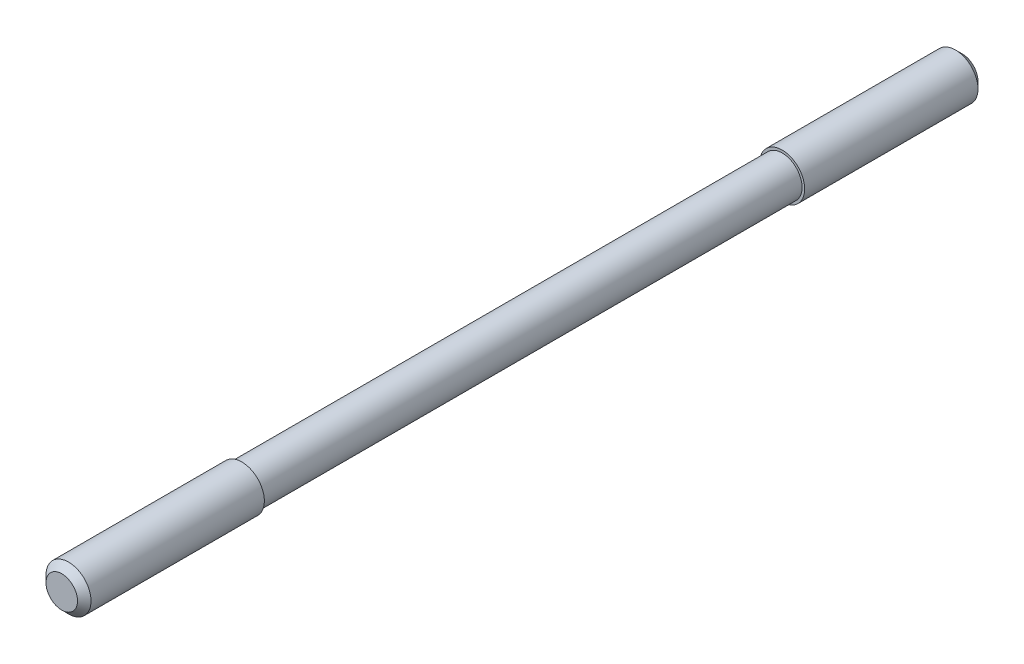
ISO-10303-21;
HEADER;
FILE_DESCRIPTION(('STEP AP214'),'2;1');
FILE_NAME('part.step','',(''),(''),'','','');
FILE_SCHEMA(('AUTOMOTIVE_DESIGN { 1 0 10303 214 1 1 1 1 }'));
ENDSEC;
DATA;
#1=APPLICATION_CONTEXT('core data for automotive mechanical design processes');
#2=APPLICATION_PROTOCOL_DEFINITION('international standard','automotive_design',2000,#1);
#3=PRODUCT_CONTEXT('',#1,'mechanical');
#4=PRODUCT('Part','Part','',(#3));
#5=PRODUCT_RELATED_PRODUCT_CATEGORY('part','',(#4));
#6=PRODUCT_DEFINITION_FORMATION('','',#4);
#7=PRODUCT_DEFINITION_CONTEXT('part definition',#1,'design');
#8=PRODUCT_DEFINITION('design','',#6,#7);
#9=PRODUCT_DEFINITION_SHAPE('','',#8);
#10=(LENGTH_UNIT() NAMED_UNIT(*) SI_UNIT(.MILLI.,.METRE.));
#11=(NAMED_UNIT(*) PLANE_ANGLE_UNIT() SI_UNIT($,.RADIAN.));
#12=(NAMED_UNIT(*) SI_UNIT($,.STERADIAN.) SOLID_ANGLE_UNIT());
#13=UNCERTAINTY_MEASURE_WITH_UNIT(LENGTH_MEASURE(1.E-05),#10,'distance_accuracy_value','');
#14=(GEOMETRIC_REPRESENTATION_CONTEXT(3) GLOBAL_UNCERTAINTY_ASSIGNED_CONTEXT((#13)) GLOBAL_UNIT_ASSIGNED_CONTEXT((#10,
#11,#12)) REPRESENTATION_CONTEXT('',''));
#15=CARTESIAN_POINT('',(0.,0.,0.));
#16=DIRECTION('',(0.,0.,1.));
#17=DIRECTION('',(1.,0.,0.));
#18=AXIS2_PLACEMENT_3D('',#15,#16,#17);
#19=CARTESIAN_POINT('',(0.,0.,0.));
#20=DIRECTION('',(0.,0.,1.));
#21=DIRECTION('',(1.,0.,0.));
#22=AXIS2_PLACEMENT_3D('',#19,#20,#21);
#23=PLANE('',#22);
#24=CARTESIAN_POINT('',(0.,0.,0.));
#25=DIRECTION('',(0.,0.,1.));
#26=DIRECTION('',(1.,0.,0.));
#27=AXIS2_PLACEMENT_3D('',#24,#25,#26);
#28=CIRCLE('',#27,2.8);
#29=CARTESIAN_POINT('',(2.8,0.,0.));
#30=VERTEX_POINT('',#29);
#31=EDGE_CURVE('E8',#30,#30,#28,.T.);
#32=ORIENTED_EDGE('',*,*,#31,.F.);
#33=EDGE_LOOP('',(#32));
#34=FACE_BOUND('',#33,.T.);
#35=ADVANCED_FACE('F12',(#34),#23,.F.);
#36=CARTESIAN_POINT('',(0.,0.,1.2));
#37=DIRECTION('',(0.,0.,1.));
#38=DIRECTION('',(1.,0.,0.));
#39=AXIS2_PLACEMENT_3D('',#36,#37,#38);
#40=CONICAL_SURFACE('',#39,4.,0.785398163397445);
#41=ORIENTED_EDGE('',*,*,#31,.T.);
#42=EDGE_LOOP('',(#41));
#43=FACE_BOUND('',#42,.T.);
#44=CARTESIAN_POINT('',(0.,0.,1.2));
#45=DIRECTION('',(0.,0.,1.));
#46=DIRECTION('',(1.,0.,0.));
#47=AXIS2_PLACEMENT_3D('',#44,#45,#46);
#48=CIRCLE('',#47,4.);
#49=CARTESIAN_POINT('',(4.,0.,1.2));
#50=VERTEX_POINT('',#49);
#51=EDGE_CURVE('E18',#50,#50,#48,.T.);
#52=ORIENTED_EDGE('',*,*,#51,.F.);
#53=EDGE_LOOP('',(#52));
#54=FACE_BOUND('',#53,.T.);
#55=ADVANCED_FACE('F61',(#43,#54),#40,.T.);
#56=CARTESIAN_POINT('',(0.,0.,70.));
#57=DIRECTION('',(0.,0.,1.));
#58=DIRECTION('',(1.,0.,0.));
#59=AXIS2_PLACEMENT_3D('',#56,#57,#58);
#60=CYLINDRICAL_SURFACE('',#59,4.);
#61=CARTESIAN_POINT('',(0.,0.,32.));
#62=DIRECTION('',(0.,0.,1.));
#63=DIRECTION('',(1.,0.,0.));
#64=AXIS2_PLACEMENT_3D('',#61,#62,#63);
#65=CIRCLE('',#64,4.);
#66=CARTESIAN_POINT('',(4.,0.,32.));
#67=VERTEX_POINT('',#66);
#68=EDGE_CURVE('E22',#67,#67,#65,.T.);
#69=ORIENTED_EDGE('',*,*,#68,.F.);
#70=EDGE_LOOP('',(#69));
#71=FACE_BOUND('',#70,.T.);
#72=ORIENTED_EDGE('',*,*,#51,.T.);
#73=EDGE_LOOP('',(#72));
#74=FACE_BOUND('',#73,.T.);
#75=ADVANCED_FACE('F66',(#71,#74),#60,.T.);
#76=CARTESIAN_POINT('',(4.,0.,32.));
#77=DIRECTION('',(0.,0.,-1.));
#78=DIRECTION('',(-1.,0.,0.));
#79=AXIS2_PLACEMENT_3D('',#76,#77,#78);
#80=PLANE('',#79);
#81=CARTESIAN_POINT('',(0.,0.,32.));
#82=DIRECTION('',(0.,0.,1.));
#83=DIRECTION('',(1.,0.,0.));
#84=AXIS2_PLACEMENT_3D('',#81,#82,#83);
#85=CIRCLE('',#84,3.55);
#86=CARTESIAN_POINT('',(3.55,0.,32.));
#87=VERTEX_POINT('',#86);
#88=EDGE_CURVE('E26',#87,#87,#85,.T.);
#89=ORIENTED_EDGE('',*,*,#88,.F.);
#90=EDGE_LOOP('',(#89));
#91=FACE_BOUND('',#90,.T.);
#92=ORIENTED_EDGE('',*,*,#68,.T.);
#93=EDGE_LOOP('',(#92));
#94=FACE_BOUND('',#93,.T.);
#95=ADVANCED_FACE('F70',(#91,#94),#80,.F.);
#96=CARTESIAN_POINT('',(0.,0.,70.));
#97=DIRECTION('',(0.,0.,1.));
#98=DIRECTION('',(1.,0.,0.));
#99=AXIS2_PLACEMENT_3D('',#96,#97,#98);
#100=CYLINDRICAL_SURFACE('',#99,3.55);
#101=CARTESIAN_POINT('',(0.,0.,128.));
#102=DIRECTION('',(0.,0.,1.));
#103=DIRECTION('',(1.,0.,0.));
#104=AXIS2_PLACEMENT_3D('',#101,#102,#103);
#105=CIRCLE('',#104,3.55);
#106=CARTESIAN_POINT('',(3.55,0.,128.));
#107=VERTEX_POINT('',#106);
#108=EDGE_CURVE('E31',#107,#107,#105,.T.);
#109=ORIENTED_EDGE('',*,*,#108,.F.);
#110=EDGE_LOOP('',(#109));
#111=FACE_BOUND('',#110,.T.);
#112=ORIENTED_EDGE('',*,*,#88,.T.);
#113=EDGE_LOOP('',(#112));
#114=FACE_BOUND('',#113,.T.);
#115=ADVANCED_FACE('F77',(#111,#114),#100,.T.);
#116=CARTESIAN_POINT('',(3.55,0.,128.));
#117=DIRECTION('',(0.,0.,1.));
#118=DIRECTION('',(1.,0.,0.));
#119=AXIS2_PLACEMENT_3D('',#116,#117,#118);
#120=PLANE('',#119);
#121=CARTESIAN_POINT('',(0.,0.,128.));
#122=DIRECTION('',(0.,0.,1.));
#123=DIRECTION('',(1.,0.,0.));
#124=AXIS2_PLACEMENT_3D('',#121,#122,#123);
#125=CIRCLE('',#124,4.);
#126=CARTESIAN_POINT('',(4.,0.,128.));
#127=VERTEX_POINT('',#126);
#128=EDGE_CURVE('E34',#127,#127,#125,.T.);
#129=ORIENTED_EDGE('',*,*,#128,.F.);
#130=EDGE_LOOP('',(#129));
#131=FACE_BOUND('',#130,.T.);
#132=ORIENTED_EDGE('',*,*,#108,.T.);
#133=EDGE_LOOP('',(#132));
#134=FACE_BOUND('',#133,.T.);
#135=ADVANCED_FACE('F57',(#131,#134),#120,.F.);
#136=CARTESIAN_POINT('',(0.,0.,70.));
#137=DIRECTION('',(0.,0.,1.));
#138=DIRECTION('',(1.,0.,0.));
#139=AXIS2_PLACEMENT_3D('',#136,#137,#138);
#140=CYLINDRICAL_SURFACE('',#139,4.);
#141=CARTESIAN_POINT('',(0.,0.,158.8));
#142=DIRECTION('',(0.,0.,1.));
#143=DIRECTION('',(1.,0.,0.));
#144=AXIS2_PLACEMENT_3D('',#141,#142,#143);
#145=CIRCLE('',#144,4.);
#146=CARTESIAN_POINT('',(4.,0.,158.8));
#147=VERTEX_POINT('',#146);
#148=EDGE_CURVE('E37',#147,#147,#145,.T.);
#149=ORIENTED_EDGE('',*,*,#148,.F.);
#150=EDGE_LOOP('',(#149));
#151=FACE_BOUND('',#150,.T.);
#152=ORIENTED_EDGE('',*,*,#128,.T.);
#153=EDGE_LOOP('',(#152));
#154=FACE_BOUND('',#153,.T.);
#155=ADVANCED_FACE('F48',(#151,#154),#140,.T.);
#156=CARTESIAN_POINT('',(0.,0.,160.));
#157=DIRECTION('',(0.,0.,-1.));
#158=DIRECTION('',(-1.,0.,0.));
#159=AXIS2_PLACEMENT_3D('',#156,#157,#158);
#160=CONICAL_SURFACE('',#159,2.8,0.785398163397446);
#161=ORIENTED_EDGE('',*,*,#148,.T.);
#162=EDGE_LOOP('',(#161));
#163=FACE_BOUND('',#162,.T.);
#164=CARTESIAN_POINT('',(0.,0.,160.));
#165=DIRECTION('',(0.,0.,1.));
#166=DIRECTION('',(1.,0.,0.));
#167=AXIS2_PLACEMENT_3D('',#164,#165,#166);
#168=CIRCLE('',#167,2.8);
#169=CARTESIAN_POINT('',(2.8,0.,160.));
#170=VERTEX_POINT('',#169);
#171=EDGE_CURVE('E40',#170,#170,#168,.T.);
#172=ORIENTED_EDGE('',*,*,#171,.F.);
#173=EDGE_LOOP('',(#172));
#174=FACE_BOUND('',#173,.T.);
#175=ADVANCED_FACE('F46',(#163,#174),#160,.T.);
#176=CARTESIAN_POINT('',(2.8,0.,160.));
#177=DIRECTION('',(0.,0.,-1.));
#178=DIRECTION('',(-1.,0.,0.));
#179=AXIS2_PLACEMENT_3D('',#176,#177,#178);
#180=PLANE('',#179);
#181=ORIENTED_EDGE('',*,*,#171,.T.);
#182=EDGE_LOOP('',(#181));
#183=FACE_BOUND('',#182,.T.);
#184=ADVANCED_FACE('F44',(#183),#180,.F.);
#185=CLOSED_SHELL('',(#35,#55,#75,#95,#115,#135,#155,#175,#184));
#186=MANIFOLD_SOLID_BREP('B1',#185);
#187=ADVANCED_BREP_SHAPE_REPRESENTATION('',(#18,#186),#14);
#188=SHAPE_DEFINITION_REPRESENTATION(#9,#187);
ENDSEC;
END-ISO-10303-21;
